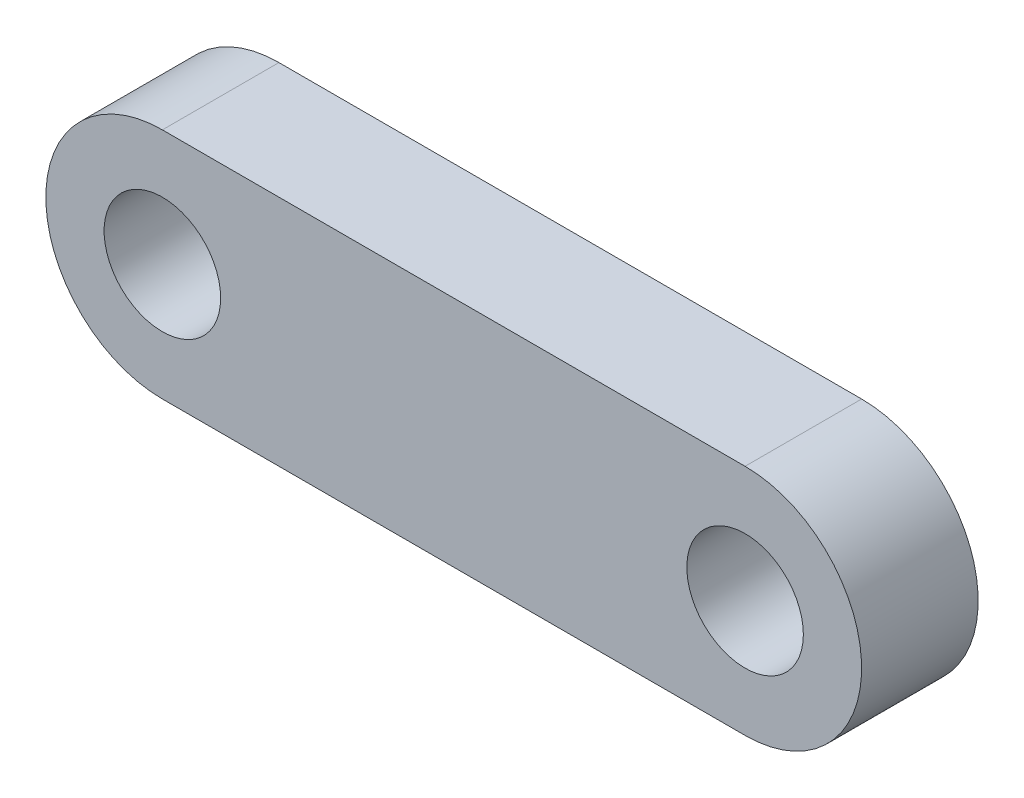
from build123d import *

# Parameters (mm, degrees)
ESQUISSE1_R          = 5
BASE_EXTRUSION_DEPTH = 5


with BuildPart() as part:
    # Esquisse1 → Base-Extrusion (new, symmetric)
    with BuildSketch(Plane.XY):
        with BuildLine():
            Line((0, 10), (50, 10))
            ThreePointArc((50, 10), (60, 0), (50, -10))
            Line((50, -10), (0, -10))
            ThreePointArc((0, -10), (-10, 0), (0, 10))
        make_face()
        Circle(ESQUISSE1_R, mode=Mode.SUBTRACT)
        with Locations((50, 0)):
            Circle(ESQUISSE1_R, mode=Mode.SUBTRACT)
    extrude(amount=BASE_EXTRUSION_DEPTH, both=True)


solid = part.part
